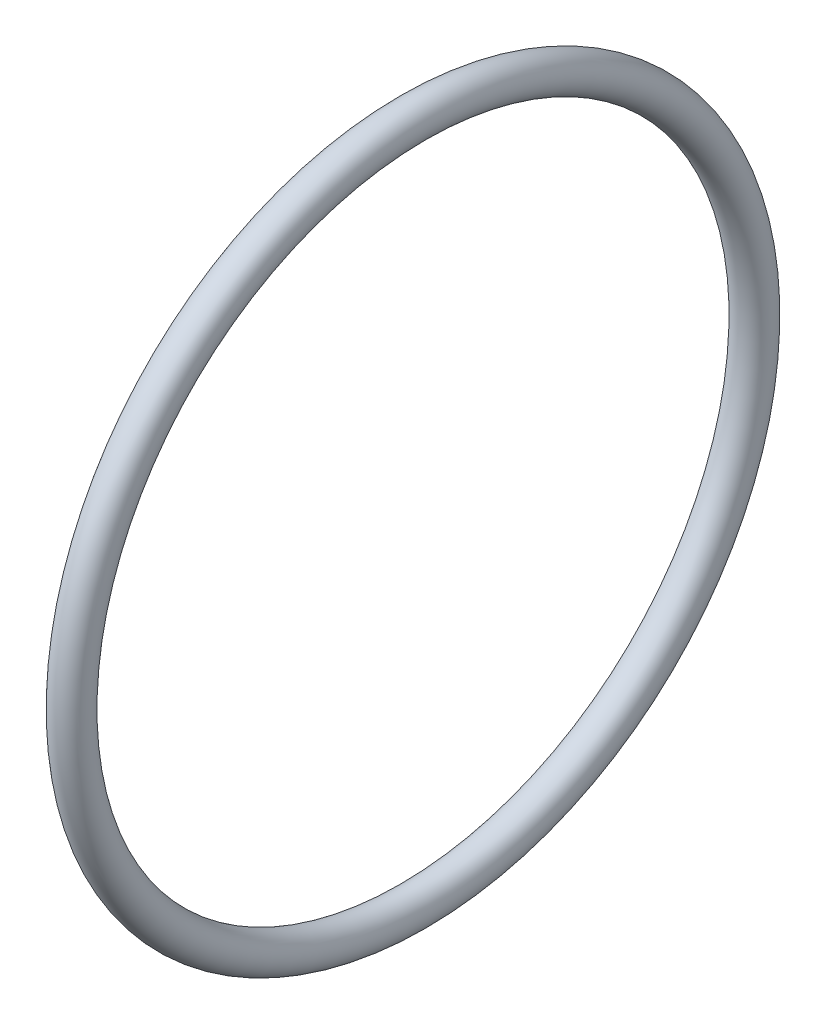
from build123d import *

# Parameters (mm, degrees)
SKETCH1_R = 2.38125


with BuildPart() as part:
    # Sweep1: sweep along a path in Sketch3
    with BuildLine(Plane(origin=(0, 0, 0), x_dir=(0, 0, -1), z_dir=(1, 0, 0))) as sweep1_path:
        CenterArc((0, 47.625), 47.625, 0, 360)
    # Sketch1 → Sweep1 (sweep)
    with BuildSketch(Plane.XY):
        with Locations((0, 2.38125)):
            Circle(SKETCH1_R)
    sweep(path=sweep1_path.line)


solid = part.part
